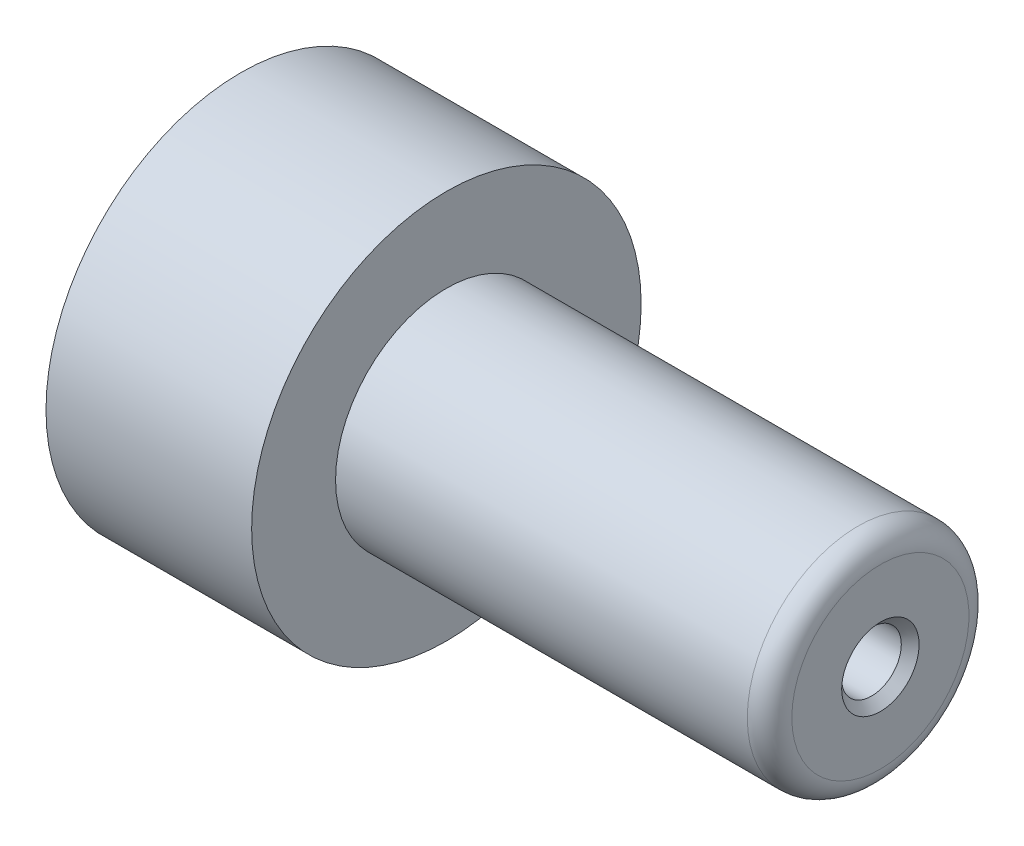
from build123d import *

# Parameters (mm, degrees)
SKETCH2_R          = 1.2065
CUT_EXTRUDE1_DEPTH = 2.54
SKETCH3_R          = 1.7018
CUT_EXTRUDE2_DEPTH = 11.0998
CHAMFER1_SIZE      = 0.508


with BuildPart() as part:
    # Sketch1 → Revolve1 (revolve)
    with BuildSketch(Plane.XY, mode=Mode.PRIVATE) as revolve1_sk:
        with BuildLine():
            Line((0, 3.9751), (0, 11.1125))
            Line((0, 11.1125), (11.7348, 11.1125))
            Line((11.7348, 11.1125), (11.7348, 6.3246))
            Line((11.7348, 6.3246), (35.2298, 6.3246))
            ThreePointArc((35.2298, 6.3246), (36.127825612, 5.952625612), (36.4998, 5.0546))
            Line((36.4998, 5.0546), (36.4998, 0))
            Line((36.4998, 0), (21.7678, 0))
            Line((21.7678, 0), (21.7678, 3.9751))
            Line((21.7678, 3.9751), (0, 3.9751))
        make_face()
    revolve(revolve1_sk.sketch.rotate(Axis((0, 0, 0), (1, 0, 0)), 90), axis=Axis((0, 0, 0), (1, 0, 0)))

    # Sketch2 → Cut-Extrude1 (cut)
    with BuildSketch(Plane.ZY):
        with Locations((0, 6.7437)):
            Circle(SKETCH2_R)
        with Locations(Location((0, -6.7437, 0), (0, 0, 180))):
            Circle(SKETCH2_R)
    extrude(amount=-CUT_EXTRUDE1_DEPTH, mode=Mode.SUBTRACT)

    # Sketch3 → Cut-Extrude2 (cut)
    with BuildSketch(Plane(origin=(36.4998, 0, 0), x_dir=(0, 0, -1), z_dir=(1, 0, 0))):
        Circle(SKETCH3_R)
    extrude(amount=-CUT_EXTRUDE2_DEPTH, mode=Mode.SUBTRACT)

    # Chamfer1
    chamfer1_edges = [part.edges().sort_by_distance(p)[0] for p in [
        (36.4998, 0, 1.7018),
    ]]
    chamfer(chamfer1_edges, length=CHAMFER1_SIZE)


solid = part.part
